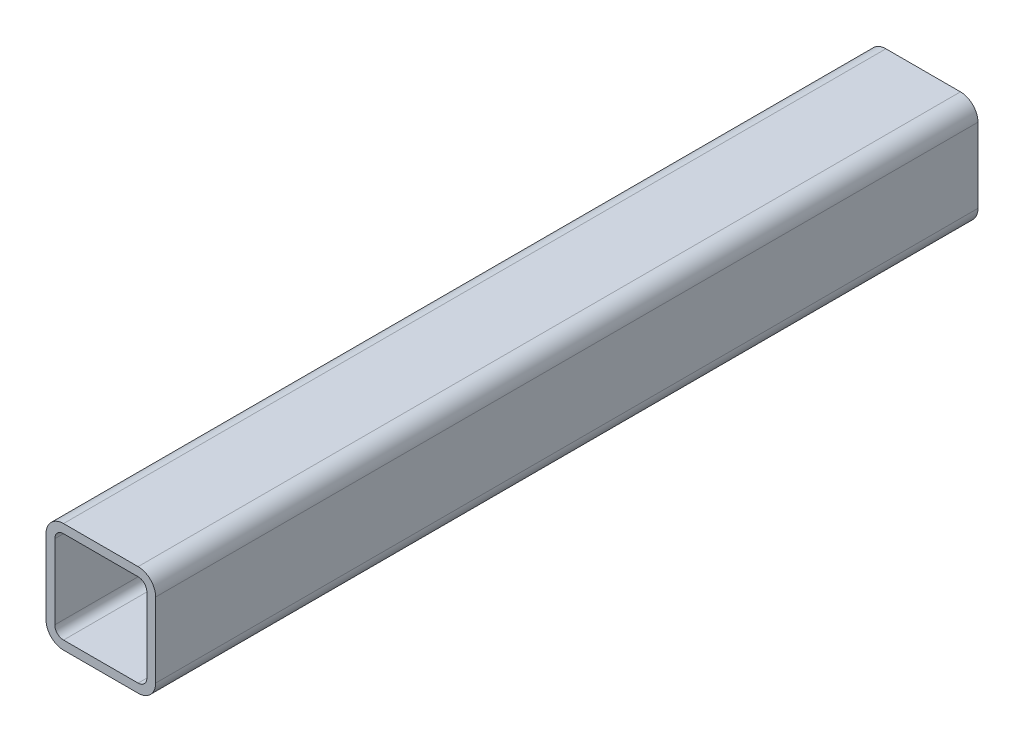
ISO-10303-21;
HEADER;
FILE_DESCRIPTION(('STEP AP214'),'2;1');
FILE_NAME('part.step','',(''),(''),'','','');
FILE_SCHEMA(('AUTOMOTIVE_DESIGN { 1 0 10303 214 1 1 1 1 }'));
ENDSEC;
DATA;
#1=APPLICATION_CONTEXT('core data for automotive mechanical design processes');
#2=APPLICATION_PROTOCOL_DEFINITION('international standard','automotive_design',2000,#1);
#3=PRODUCT_CONTEXT('',#1,'mechanical');
#4=PRODUCT('Part','Part','',(#3));
#5=PRODUCT_RELATED_PRODUCT_CATEGORY('part','',(#4));
#6=PRODUCT_DEFINITION_FORMATION('','',#4);
#7=PRODUCT_DEFINITION_CONTEXT('part definition',#1,'design');
#8=PRODUCT_DEFINITION('design','',#6,#7);
#9=PRODUCT_DEFINITION_SHAPE('','',#8);
#10=(LENGTH_UNIT() NAMED_UNIT(*) SI_UNIT(.MILLI.,.METRE.));
#11=(NAMED_UNIT(*) PLANE_ANGLE_UNIT() SI_UNIT($,.RADIAN.));
#12=(NAMED_UNIT(*) SI_UNIT($,.STERADIAN.) SOLID_ANGLE_UNIT());
#13=UNCERTAINTY_MEASURE_WITH_UNIT(LENGTH_MEASURE(1.E-05),#10,'distance_accuracy_value','');
#14=(GEOMETRIC_REPRESENTATION_CONTEXT(3) GLOBAL_UNCERTAINTY_ASSIGNED_CONTEXT((#13)) GLOBAL_UNIT_ASSIGNED_CONTEXT((#10,
#11,#12)) REPRESENTATION_CONTEXT('',''));
#15=CARTESIAN_POINT('',(0.,0.,0.));
#16=DIRECTION('',(0.,0.,1.));
#17=DIRECTION('',(1.,0.,0.));
#18=AXIS2_PLACEMENT_3D('',#15,#16,#17);
#19=CARTESIAN_POINT('',(-34.,34.,375.));
#20=DIRECTION('',(0.,0.,1.));
#21=DIRECTION('',(1.,0.,0.));
#22=AXIS2_PLACEMENT_3D('',#19,#20,#21);
#23=PLANE('',#22);
#24=CARTESIAN_POINT('',(-34.,34.,375.));
#25=DIRECTION('',(0.,0.,1.));
#26=DIRECTION('',(1.,0.,0.));
#27=AXIS2_PLACEMENT_3D('',#24,#25,#26);
#28=CIRCLE('',#27,16.);
#29=CARTESIAN_POINT('',(-34.,50.,375.));
#30=VERTEX_POINT('',#29);
#31=CARTESIAN_POINT('',(-50.,34.,375.));
#32=VERTEX_POINT('',#31);
#33=EDGE_CURVE('E258',#30,#32,#28,.T.);
#34=ORIENTED_EDGE('',*,*,#33,.T.);
#35=DIRECTION('',(0.,-1.,0.));
#36=VECTOR('',#35,1.);
#37=CARTESIAN_POINT('',(-50.,34.,375.));
#38=LINE('',#37,#36);
#39=CARTESIAN_POINT('',(-50.,-34.,375.));
#40=VERTEX_POINT('',#39);
#41=EDGE_CURVE('E261',#32,#40,#38,.T.);
#42=ORIENTED_EDGE('',*,*,#41,.T.);
#43=CARTESIAN_POINT('',(-34.,-34.,375.));
#44=DIRECTION('',(0.,0.,1.));
#45=DIRECTION('',(1.,0.,0.));
#46=AXIS2_PLACEMENT_3D('',#43,#44,#45);
#47=CIRCLE('',#46,16.);
#48=CARTESIAN_POINT('',(-34.,-50.,375.));
#49=VERTEX_POINT('',#48);
#50=EDGE_CURVE('E264',#40,#49,#47,.T.);
#51=ORIENTED_EDGE('',*,*,#50,.T.);
#52=DIRECTION('',(1.,0.,0.));
#53=VECTOR('',#52,1.);
#54=CARTESIAN_POINT('',(-34.,-50.,375.));
#55=LINE('',#54,#53);
#56=CARTESIAN_POINT('',(34.,-50.,375.));
#57=VERTEX_POINT('',#56);
#58=EDGE_CURVE('E266',#49,#57,#55,.T.);
#59=ORIENTED_EDGE('',*,*,#58,.T.);
#60=CARTESIAN_POINT('',(34.,-34.,375.));
#61=DIRECTION('',(0.,0.,1.));
#62=DIRECTION('',(1.,0.,0.));
#63=AXIS2_PLACEMENT_3D('',#60,#61,#62);
#64=CIRCLE('',#63,16.);
#65=CARTESIAN_POINT('',(50.,-34.,375.));
#66=VERTEX_POINT('',#65);
#67=EDGE_CURVE('E268',#57,#66,#64,.T.);
#68=ORIENTED_EDGE('',*,*,#67,.T.);
#69=DIRECTION('',(0.,1.,0.));
#70=VECTOR('',#69,1.);
#71=CARTESIAN_POINT('',(50.,34.,375.));
#72=LINE('',#71,#70);
#73=CARTESIAN_POINT('',(50.,34.,375.));
#74=VERTEX_POINT('',#73);
#75=EDGE_CURVE('E270',#66,#74,#72,.T.);
#76=ORIENTED_EDGE('',*,*,#75,.T.);
#77=CARTESIAN_POINT('',(34.,34.,375.));
#78=DIRECTION('',(0.,0.,1.));
#79=DIRECTION('',(-1.,0.,0.));
#80=AXIS2_PLACEMENT_3D('',#77,#78,#79);
#81=CIRCLE('',#80,16.);
#82=CARTESIAN_POINT('',(34.,50.,375.));
#83=VERTEX_POINT('',#82);
#84=EDGE_CURVE('E272',#74,#83,#81,.T.);
#85=ORIENTED_EDGE('',*,*,#84,.T.);
#86=DIRECTION('',(-1.,0.,0.));
#87=VECTOR('',#86,1.);
#88=CARTESIAN_POINT('',(-34.,50.,375.));
#89=LINE('',#88,#87);
#90=EDGE_CURVE('E274',#83,#30,#89,.T.);
#91=ORIENTED_EDGE('',*,*,#90,.T.);
#92=EDGE_LOOP('',(#34,#42,#51,#59,#68,#76,#85,#91));
#93=FACE_BOUND('',#92,.T.);
#94=DIRECTION('',(0.,-1.,0.));
#95=VECTOR('',#94,1.);
#96=CARTESIAN_POINT('',(-42.,34.,375.));
#97=LINE('',#96,#95);
#98=CARTESIAN_POINT('',(-42.,34.,375.));
#99=VERTEX_POINT('',#98);
#100=CARTESIAN_POINT('',(-42.,-34.,375.));
#101=VERTEX_POINT('',#100);
#102=EDGE_CURVE('E201',#99,#101,#97,.T.);
#103=ORIENTED_EDGE('',*,*,#102,.F.);
#104=CARTESIAN_POINT('',(-34.,34.,375.));
#105=DIRECTION('',(0.,0.,1.));
#106=DIRECTION('',(1.,0.,0.));
#107=AXIS2_PLACEMENT_3D('',#104,#105,#106);
#108=CIRCLE('',#107,8.);
#109=CARTESIAN_POINT('',(-34.,42.,375.));
#110=VERTEX_POINT('',#109);
#111=EDGE_CURVE('E193',#110,#99,#108,.T.);
#112=ORIENTED_EDGE('',*,*,#111,.F.);
#113=DIRECTION('',(-1.,0.,0.));
#114=VECTOR('',#113,1.);
#115=CARTESIAN_POINT('',(-34.,42.,375.));
#116=LINE('',#115,#114);
#117=CARTESIAN_POINT('',(34.,42.,375.));
#118=VERTEX_POINT('',#117);
#119=EDGE_CURVE('E226',#118,#110,#116,.T.);
#120=ORIENTED_EDGE('',*,*,#119,.F.);
#121=CARTESIAN_POINT('',(34.,34.,375.));
#122=DIRECTION('',(0.,0.,1.));
#123=DIRECTION('',(1.,0.,0.));
#124=AXIS2_PLACEMENT_3D('',#121,#122,#123);
#125=CIRCLE('',#124,8.);
#126=CARTESIAN_POINT('',(42.,34.,375.));
#127=VERTEX_POINT('',#126);
#128=EDGE_CURVE('E224',#127,#118,#125,.T.);
#129=ORIENTED_EDGE('',*,*,#128,.F.);
#130=DIRECTION('',(0.,1.,0.));
#131=VECTOR('',#130,1.);
#132=CARTESIAN_POINT('',(42.,34.,375.));
#133=LINE('',#132,#131);
#134=CARTESIAN_POINT('',(42.,-34.,375.));
#135=VERTEX_POINT('',#134);
#136=EDGE_CURVE('E222',#135,#127,#133,.T.);
#137=ORIENTED_EDGE('',*,*,#136,.F.);
#138=CARTESIAN_POINT('',(34.,-34.,375.));
#139=DIRECTION('',(0.,0.,1.));
#140=DIRECTION('',(1.,0.,0.));
#141=AXIS2_PLACEMENT_3D('',#138,#139,#140);
#142=CIRCLE('',#141,8.);
#143=CARTESIAN_POINT('',(34.,-42.,375.));
#144=VERTEX_POINT('',#143);
#145=EDGE_CURVE('E220',#144,#135,#142,.T.);
#146=ORIENTED_EDGE('',*,*,#145,.F.);
#147=DIRECTION('',(1.,0.,0.));
#148=VECTOR('',#147,1.);
#149=CARTESIAN_POINT('',(-34.,-42.,375.));
#150=LINE('',#149,#148);
#151=CARTESIAN_POINT('',(-34.,-42.,375.));
#152=VERTEX_POINT('',#151);
#153=EDGE_CURVE('E216',#152,#144,#150,.T.);
#154=ORIENTED_EDGE('',*,*,#153,.F.);
#155=CARTESIAN_POINT('',(-34.,-34.,375.));
#156=DIRECTION('',(0.,0.,1.));
#157=DIRECTION('',(1.,0.,0.));
#158=AXIS2_PLACEMENT_3D('',#155,#156,#157);
#159=CIRCLE('',#158,8.);
#160=EDGE_CURVE('E214',#101,#152,#159,.T.);
#161=ORIENTED_EDGE('',*,*,#160,.F.);
#162=EDGE_LOOP('',(#103,#112,#120,#129,#137,#146,#154,#161));
#163=FACE_BOUND('',#162,.T.);
#164=ADVANCED_FACE('F80',(#93,#163),#23,.T.);
#165=CARTESIAN_POINT('',(-34.,34.,-375.));
#166=DIRECTION('',(0.,0.,1.));
#167=DIRECTION('',(1.,0.,0.));
#168=AXIS2_PLACEMENT_3D('',#165,#166,#167);
#169=PLANE('',#168);
#170=CARTESIAN_POINT('',(-34.,34.,-375.));
#171=DIRECTION('',(0.,0.,1.));
#172=DIRECTION('',(1.,0.,0.));
#173=AXIS2_PLACEMENT_3D('',#170,#171,#172);
#174=CIRCLE('',#173,16.);
#175=CARTESIAN_POINT('',(-34.,50.,-375.));
#176=VERTEX_POINT('',#175);
#177=CARTESIAN_POINT('',(-50.,34.,-375.));
#178=VERTEX_POINT('',#177);
#179=EDGE_CURVE('E209',#176,#178,#174,.T.);
#180=ORIENTED_EDGE('',*,*,#179,.F.);
#181=DIRECTION('',(-1.,0.,0.));
#182=VECTOR('',#181,1.);
#183=CARTESIAN_POINT('',(-34.,50.,-375.));
#184=LINE('',#183,#182);
#185=CARTESIAN_POINT('',(34.,50.,-375.));
#186=VERTEX_POINT('',#185);
#187=EDGE_CURVE('E262',#186,#176,#184,.T.);
#188=ORIENTED_EDGE('',*,*,#187,.F.);
#189=CARTESIAN_POINT('',(34.,34.,-375.));
#190=DIRECTION('',(0.,0.,1.));
#191=DIRECTION('',(-1.,0.,0.));
#192=AXIS2_PLACEMENT_3D('',#189,#190,#191);
#193=CIRCLE('',#192,16.);
#194=CARTESIAN_POINT('',(50.,34.,-375.));
#195=VERTEX_POINT('',#194);
#196=EDGE_CURVE('E289',#195,#186,#193,.T.);
#197=ORIENTED_EDGE('',*,*,#196,.F.);
#198=DIRECTION('',(0.,1.,0.));
#199=VECTOR('',#198,1.);
#200=CARTESIAN_POINT('',(50.,34.,-375.));
#201=LINE('',#200,#199);
#202=CARTESIAN_POINT('',(50.,-34.,-375.));
#203=VERTEX_POINT('',#202);
#204=EDGE_CURVE('E287',#203,#195,#201,.T.);
#205=ORIENTED_EDGE('',*,*,#204,.F.);
#206=CARTESIAN_POINT('',(34.,-34.,-375.));
#207=DIRECTION('',(0.,0.,1.));
#208=DIRECTION('',(1.,0.,0.));
#209=AXIS2_PLACEMENT_3D('',#206,#207,#208);
#210=CIRCLE('',#209,16.);
#211=CARTESIAN_POINT('',(34.,-50.,-375.));
#212=VERTEX_POINT('',#211);
#213=EDGE_CURVE('E285',#212,#203,#210,.T.);
#214=ORIENTED_EDGE('',*,*,#213,.F.);
#215=DIRECTION('',(1.,0.,0.));
#216=VECTOR('',#215,1.);
#217=CARTESIAN_POINT('',(-34.,-50.,-375.));
#218=LINE('',#217,#216);
#219=CARTESIAN_POINT('',(-34.,-50.,-375.));
#220=VERTEX_POINT('',#219);
#221=EDGE_CURVE('E283',#220,#212,#218,.T.);
#222=ORIENTED_EDGE('',*,*,#221,.F.);
#223=CARTESIAN_POINT('',(-34.,-34.,-375.));
#224=DIRECTION('',(0.,0.,1.));
#225=DIRECTION('',(1.,0.,0.));
#226=AXIS2_PLACEMENT_3D('',#223,#224,#225);
#227=CIRCLE('',#226,16.);
#228=CARTESIAN_POINT('',(-50.,-34.,-375.));
#229=VERTEX_POINT('',#228);
#230=EDGE_CURVE('E281',#229,#220,#227,.T.);
#231=ORIENTED_EDGE('',*,*,#230,.F.);
#232=DIRECTION('',(0.,-1.,0.));
#233=VECTOR('',#232,1.);
#234=CARTESIAN_POINT('',(-50.,34.,-375.));
#235=LINE('',#234,#233);
#236=EDGE_CURVE('E279',#178,#229,#235,.T.);
#237=ORIENTED_EDGE('',*,*,#236,.F.);
#238=EDGE_LOOP('',(#180,#188,#197,#205,#214,#222,#231,#237));
#239=FACE_BOUND('',#238,.T.);
#240=CARTESIAN_POINT('',(-34.,34.,-375.));
#241=DIRECTION('',(0.,0.,1.));
#242=DIRECTION('',(1.,0.,0.));
#243=AXIS2_PLACEMENT_3D('',#240,#241,#242);
#244=CIRCLE('',#243,8.);
#245=CARTESIAN_POINT('',(-34.,42.,-375.));
#246=VERTEX_POINT('',#245);
#247=CARTESIAN_POINT('',(-42.,34.,-375.));
#248=VERTEX_POINT('',#247);
#249=EDGE_CURVE('E103',#246,#248,#244,.T.);
#250=ORIENTED_EDGE('',*,*,#249,.T.);
#251=DIRECTION('',(0.,-1.,0.));
#252=VECTOR('',#251,1.);
#253=CARTESIAN_POINT('',(-42.,34.,-375.));
#254=LINE('',#253,#252);
#255=CARTESIAN_POINT('',(-42.,-34.,-375.));
#256=VERTEX_POINT('',#255);
#257=EDGE_CURVE('E208',#248,#256,#254,.T.);
#258=ORIENTED_EDGE('',*,*,#257,.T.);
#259=CARTESIAN_POINT('',(-34.,-34.,-375.));
#260=DIRECTION('',(0.,0.,1.));
#261=DIRECTION('',(1.,0.,0.));
#262=AXIS2_PLACEMENT_3D('',#259,#260,#261);
#263=CIRCLE('',#262,8.);
#264=CARTESIAN_POINT('',(-34.,-42.,-375.));
#265=VERTEX_POINT('',#264);
#266=EDGE_CURVE('E230',#256,#265,#263,.T.);
#267=ORIENTED_EDGE('',*,*,#266,.T.);
#268=DIRECTION('',(1.,0.,0.));
#269=VECTOR('',#268,1.);
#270=CARTESIAN_POINT('',(-34.,-42.,-375.));
#271=LINE('',#270,#269);
#272=CARTESIAN_POINT('',(34.,-42.,-375.));
#273=VERTEX_POINT('',#272);
#274=EDGE_CURVE('E233',#265,#273,#271,.T.);
#275=ORIENTED_EDGE('',*,*,#274,.T.);
#276=CARTESIAN_POINT('',(34.,-34.,-375.));
#277=DIRECTION('',(0.,0.,1.));
#278=DIRECTION('',(1.,0.,0.));
#279=AXIS2_PLACEMENT_3D('',#276,#277,#278);
#280=CIRCLE('',#279,8.);
#281=CARTESIAN_POINT('',(42.,-34.,-375.));
#282=VERTEX_POINT('',#281);
#283=EDGE_CURVE('E236',#273,#282,#280,.T.);
#284=ORIENTED_EDGE('',*,*,#283,.T.);
#285=DIRECTION('',(0.,1.,0.));
#286=VECTOR('',#285,1.);
#287=CARTESIAN_POINT('',(42.,34.,-375.));
#288=LINE('',#287,#286);
#289=CARTESIAN_POINT('',(42.,34.,-375.));
#290=VERTEX_POINT('',#289);
#291=EDGE_CURVE('E239',#282,#290,#288,.T.);
#292=ORIENTED_EDGE('',*,*,#291,.T.);
#293=CARTESIAN_POINT('',(34.,34.,-375.));
#294=DIRECTION('',(0.,0.,1.));
#295=DIRECTION('',(1.,0.,0.));
#296=AXIS2_PLACEMENT_3D('',#293,#294,#295);
#297=CIRCLE('',#296,8.);
#298=CARTESIAN_POINT('',(34.,42.,-375.));
#299=VERTEX_POINT('',#298);
#300=EDGE_CURVE('E242',#290,#299,#297,.T.);
#301=ORIENTED_EDGE('',*,*,#300,.T.);
#302=DIRECTION('',(-1.,0.,0.));
#303=VECTOR('',#302,1.);
#304=CARTESIAN_POINT('',(-34.,42.,-375.));
#305=LINE('',#304,#303);
#306=EDGE_CURVE('E202',#299,#246,#305,.T.);
#307=ORIENTED_EDGE('',*,*,#306,.T.);
#308=EDGE_LOOP('',(#250,#258,#267,#275,#284,#292,#301,#307));
#309=FACE_BOUND('',#308,.T.);
#310=ADVANCED_FACE('F319',(#239,#309),#169,.F.);
#311=CARTESIAN_POINT('',(-34.,34.,375.));
#312=DIRECTION('',(0.,0.,-1.));
#313=DIRECTION('',(-1.,0.,0.));
#314=AXIS2_PLACEMENT_3D('',#311,#312,#313);
#315=CYLINDRICAL_SURFACE('',#314,16.);
#316=ORIENTED_EDGE('',*,*,#179,.T.);
#317=DIRECTION('',(0.,0.,-1.));
#318=VECTOR('',#317,1.);
#319=CARTESIAN_POINT('',(-50.,34.,375.));
#320=LINE('',#319,#318);
#321=EDGE_CURVE('E12',#32,#178,#320,.T.);
#322=ORIENTED_EDGE('',*,*,#321,.F.);
#323=ORIENTED_EDGE('',*,*,#33,.F.);
#324=DIRECTION('',(0.,0.,-1.));
#325=VECTOR('',#324,1.);
#326=CARTESIAN_POINT('',(-34.,50.,375.));
#327=LINE('',#326,#325);
#328=EDGE_CURVE('E276',#30,#176,#327,.T.);
#329=ORIENTED_EDGE('',*,*,#328,.T.);
#330=EDGE_LOOP('',(#316,#322,#323,#329));
#331=FACE_BOUND('',#330,.T.);
#332=ADVANCED_FACE('F82',(#331),#315,.T.);
#333=CARTESIAN_POINT('',(-50.,34.,375.));
#334=DIRECTION('',(1.,0.,0.));
#335=DIRECTION('',(0.,1.,0.));
#336=AXIS2_PLACEMENT_3D('',#333,#334,#335);
#337=PLANE('',#336);
#338=ORIENTED_EDGE('',*,*,#236,.T.);
#339=DIRECTION('',(0.,0.,-1.));
#340=VECTOR('',#339,1.);
#341=CARTESIAN_POINT('',(-50.,-34.,375.));
#342=LINE('',#341,#340);
#343=EDGE_CURVE('E88',#40,#229,#342,.T.);
#344=ORIENTED_EDGE('',*,*,#343,.F.);
#345=ORIENTED_EDGE('',*,*,#41,.F.);
#346=ORIENTED_EDGE('',*,*,#321,.T.);
#347=EDGE_LOOP('',(#338,#344,#345,#346));
#348=FACE_BOUND('',#347,.T.);
#349=ADVANCED_FACE('F336',(#348),#337,.F.);
#350=CARTESIAN_POINT('',(-34.,-34.,375.));
#351=DIRECTION('',(0.,0.,-1.));
#352=DIRECTION('',(-1.,0.,0.));
#353=AXIS2_PLACEMENT_3D('',#350,#351,#352);
#354=CYLINDRICAL_SURFACE('',#353,16.);
#355=ORIENTED_EDGE('',*,*,#230,.T.);
#356=DIRECTION('',(0.,0.,-1.));
#357=VECTOR('',#356,1.);
#358=CARTESIAN_POINT('',(-34.,-50.,375.));
#359=LINE('',#358,#357);
#360=EDGE_CURVE('E306',#49,#220,#359,.T.);
#361=ORIENTED_EDGE('',*,*,#360,.F.);
#362=ORIENTED_EDGE('',*,*,#50,.F.);
#363=ORIENTED_EDGE('',*,*,#343,.T.);
#364=EDGE_LOOP('',(#355,#361,#362,#363));
#365=FACE_BOUND('',#364,.T.);
#366=ADVANCED_FACE('F313',(#365),#354,.T.);
#367=CARTESIAN_POINT('',(-34.,-50.,375.));
#368=DIRECTION('',(0.,1.,0.));
#369=DIRECTION('',(0.,0.,1.));
#370=AXIS2_PLACEMENT_3D('',#367,#368,#369);
#371=PLANE('',#370);
#372=ORIENTED_EDGE('',*,*,#221,.T.);
#373=DIRECTION('',(0.,0.,-1.));
#374=VECTOR('',#373,1.);
#375=CARTESIAN_POINT('',(34.,-50.,375.));
#376=LINE('',#375,#374);
#377=EDGE_CURVE('E303',#57,#212,#376,.T.);
#378=ORIENTED_EDGE('',*,*,#377,.F.);
#379=ORIENTED_EDGE('',*,*,#58,.F.);
#380=ORIENTED_EDGE('',*,*,#360,.T.);
#381=EDGE_LOOP('',(#372,#378,#379,#380));
#382=FACE_BOUND('',#381,.T.);
#383=ADVANCED_FACE('F325',(#382),#371,.F.);
#384=CARTESIAN_POINT('',(34.,-34.,375.));
#385=DIRECTION('',(0.,0.,-1.));
#386=DIRECTION('',(-1.,0.,0.));
#387=AXIS2_PLACEMENT_3D('',#384,#385,#386);
#388=CYLINDRICAL_SURFACE('',#387,16.);
#389=ORIENTED_EDGE('',*,*,#213,.T.);
#390=DIRECTION('',(0.,0.,-1.));
#391=VECTOR('',#390,1.);
#392=CARTESIAN_POINT('',(50.,-34.,375.));
#393=LINE('',#392,#391);
#394=EDGE_CURVE('E300',#66,#203,#393,.T.);
#395=ORIENTED_EDGE('',*,*,#394,.F.);
#396=ORIENTED_EDGE('',*,*,#67,.F.);
#397=ORIENTED_EDGE('',*,*,#377,.T.);
#398=EDGE_LOOP('',(#389,#395,#396,#397));
#399=FACE_BOUND('',#398,.T.);
#400=ADVANCED_FACE('F329',(#399),#388,.T.);
#401=CARTESIAN_POINT('',(50.,34.,375.));
#402=DIRECTION('',(-1.,0.,0.));
#403=DIRECTION('',(0.,-1.,0.));
#404=AXIS2_PLACEMENT_3D('',#401,#402,#403);
#405=PLANE('',#404);
#406=ORIENTED_EDGE('',*,*,#204,.T.);
#407=DIRECTION('',(0.,0.,-1.));
#408=VECTOR('',#407,1.);
#409=CARTESIAN_POINT('',(50.,34.,375.));
#410=LINE('',#409,#408);
#411=EDGE_CURVE('E297',#74,#195,#410,.T.);
#412=ORIENTED_EDGE('',*,*,#411,.F.);
#413=ORIENTED_EDGE('',*,*,#75,.F.);
#414=ORIENTED_EDGE('',*,*,#394,.T.);
#415=EDGE_LOOP('',(#406,#412,#413,#414));
#416=FACE_BOUND('',#415,.T.);
#417=ADVANCED_FACE('F349',(#416),#405,.F.);
#418=CARTESIAN_POINT('',(34.,34.,375.));
#419=DIRECTION('',(0.,0.,-1.));
#420=DIRECTION('',(-1.,0.,0.));
#421=AXIS2_PLACEMENT_3D('',#418,#419,#420);
#422=CYLINDRICAL_SURFACE('',#421,16.);
#423=ORIENTED_EDGE('',*,*,#196,.T.);
#424=DIRECTION('',(0.,0.,-1.));
#425=VECTOR('',#424,1.);
#426=CARTESIAN_POINT('',(34.,50.,375.));
#427=LINE('',#426,#425);
#428=EDGE_CURVE('E294',#83,#186,#427,.T.);
#429=ORIENTED_EDGE('',*,*,#428,.F.);
#430=ORIENTED_EDGE('',*,*,#84,.F.);
#431=ORIENTED_EDGE('',*,*,#411,.T.);
#432=EDGE_LOOP('',(#423,#429,#430,#431));
#433=FACE_BOUND('',#432,.T.);
#434=ADVANCED_FACE('F347',(#433),#422,.T.);
#435=CARTESIAN_POINT('',(-34.,50.,375.));
#436=DIRECTION('',(0.,-1.,0.));
#437=DIRECTION('',(1.,0.,0.));
#438=AXIS2_PLACEMENT_3D('',#435,#436,#437);
#439=PLANE('',#438);
#440=ORIENTED_EDGE('',*,*,#187,.T.);
#441=ORIENTED_EDGE('',*,*,#328,.F.);
#442=ORIENTED_EDGE('',*,*,#90,.F.);
#443=ORIENTED_EDGE('',*,*,#428,.T.);
#444=EDGE_LOOP('',(#440,#441,#442,#443));
#445=FACE_BOUND('',#444,.T.);
#446=ADVANCED_FACE('F342',(#445),#439,.F.);
#447=CARTESIAN_POINT('',(-34.,34.,375.));
#448=DIRECTION('',(0.,0.,-1.));
#449=DIRECTION('',(-1.,0.,0.));
#450=AXIS2_PLACEMENT_3D('',#447,#448,#449);
#451=CYLINDRICAL_SURFACE('',#450,8.);
#452=ORIENTED_EDGE('',*,*,#249,.F.);
#453=DIRECTION('',(0.,0.,-1.));
#454=VECTOR('',#453,1.);
#455=CARTESIAN_POINT('',(-34.,42.,375.));
#456=LINE('',#455,#454);
#457=EDGE_CURVE('E197',#110,#246,#456,.T.);
#458=ORIENTED_EDGE('',*,*,#457,.F.);
#459=ORIENTED_EDGE('',*,*,#111,.T.);
#460=DIRECTION('',(0.,0.,-1.));
#461=VECTOR('',#460,1.);
#462=CARTESIAN_POINT('',(-42.,34.,375.));
#463=LINE('',#462,#461);
#464=EDGE_CURVE('E196',#99,#248,#463,.T.);
#465=ORIENTED_EDGE('',*,*,#464,.T.);
#466=EDGE_LOOP('',(#452,#458,#459,#465));
#467=FACE_BOUND('',#466,.T.);
#468=ADVANCED_FACE('F195',(#467),#451,.F.);
#469=CARTESIAN_POINT('',(-42.,34.,375.));
#470=DIRECTION('',(1.,0.,0.));
#471=DIRECTION('',(0.,1.,0.));
#472=AXIS2_PLACEMENT_3D('',#469,#470,#471);
#473=PLANE('',#472);
#474=ORIENTED_EDGE('',*,*,#257,.F.);
#475=ORIENTED_EDGE('',*,*,#464,.F.);
#476=ORIENTED_EDGE('',*,*,#102,.T.);
#477=DIRECTION('',(0.,0.,-1.));
#478=VECTOR('',#477,1.);
#479=CARTESIAN_POINT('',(-42.,-34.,375.));
#480=LINE('',#479,#478);
#481=EDGE_CURVE('E210',#101,#256,#480,.T.);
#482=ORIENTED_EDGE('',*,*,#481,.T.);
#483=EDGE_LOOP('',(#474,#475,#476,#482));
#484=FACE_BOUND('',#483,.T.);
#485=ADVANCED_FACE('F205',(#484),#473,.T.);
#486=CARTESIAN_POINT('',(-34.,-34.,375.));
#487=DIRECTION('',(0.,0.,-1.));
#488=DIRECTION('',(-1.,0.,0.));
#489=AXIS2_PLACEMENT_3D('',#486,#487,#488);
#490=CYLINDRICAL_SURFACE('',#489,8.);
#491=ORIENTED_EDGE('',*,*,#266,.F.);
#492=ORIENTED_EDGE('',*,*,#481,.F.);
#493=ORIENTED_EDGE('',*,*,#160,.T.);
#494=DIRECTION('',(0.,0.,-1.));
#495=VECTOR('',#494,1.);
#496=CARTESIAN_POINT('',(-34.,-42.,375.));
#497=LINE('',#496,#495);
#498=EDGE_CURVE('E255',#152,#265,#497,.T.);
#499=ORIENTED_EDGE('',*,*,#498,.T.);
#500=EDGE_LOOP('',(#491,#492,#493,#499));
#501=FACE_BOUND('',#500,.T.);
#502=ADVANCED_FACE('F374',(#501),#490,.F.);
#503=CARTESIAN_POINT('',(-34.,-42.,375.));
#504=DIRECTION('',(0.,1.,0.));
#505=DIRECTION('',(0.,0.,1.));
#506=AXIS2_PLACEMENT_3D('',#503,#504,#505);
#507=PLANE('',#506);
#508=ORIENTED_EDGE('',*,*,#274,.F.);
#509=ORIENTED_EDGE('',*,*,#498,.F.);
#510=ORIENTED_EDGE('',*,*,#153,.T.);
#511=DIRECTION('',(0.,0.,-1.));
#512=VECTOR('',#511,1.);
#513=CARTESIAN_POINT('',(34.,-42.,375.));
#514=LINE('',#513,#512);
#515=EDGE_CURVE('E253',#144,#273,#514,.T.);
#516=ORIENTED_EDGE('',*,*,#515,.T.);
#517=EDGE_LOOP('',(#508,#509,#510,#516));
#518=FACE_BOUND('',#517,.T.);
#519=ADVANCED_FACE('F378',(#518),#507,.T.);
#520=CARTESIAN_POINT('',(34.,-34.,375.));
#521=DIRECTION('',(0.,0.,-1.));
#522=DIRECTION('',(-1.,0.,0.));
#523=AXIS2_PLACEMENT_3D('',#520,#521,#522);
#524=CYLINDRICAL_SURFACE('',#523,8.);
#525=ORIENTED_EDGE('',*,*,#283,.F.);
#526=ORIENTED_EDGE('',*,*,#515,.F.);
#527=ORIENTED_EDGE('',*,*,#145,.T.);
#528=DIRECTION('',(0.,0.,-1.));
#529=VECTOR('',#528,1.);
#530=CARTESIAN_POINT('',(42.,-34.,375.));
#531=LINE('',#530,#529);
#532=EDGE_CURVE('E251',#135,#282,#531,.T.);
#533=ORIENTED_EDGE('',*,*,#532,.T.);
#534=EDGE_LOOP('',(#525,#526,#527,#533));
#535=FACE_BOUND('',#534,.T.);
#536=ADVANCED_FACE('F384',(#535),#524,.F.);
#537=CARTESIAN_POINT('',(42.,34.,375.));
#538=DIRECTION('',(-1.,0.,0.));
#539=DIRECTION('',(0.,-1.,0.));
#540=AXIS2_PLACEMENT_3D('',#537,#538,#539);
#541=PLANE('',#540);
#542=ORIENTED_EDGE('',*,*,#291,.F.);
#543=ORIENTED_EDGE('',*,*,#532,.F.);
#544=ORIENTED_EDGE('',*,*,#136,.T.);
#545=DIRECTION('',(0.,0.,-1.));
#546=VECTOR('',#545,1.);
#547=CARTESIAN_POINT('',(42.,34.,375.));
#548=LINE('',#547,#546);
#549=EDGE_CURVE('E249',#127,#290,#548,.T.);
#550=ORIENTED_EDGE('',*,*,#549,.T.);
#551=EDGE_LOOP('',(#542,#543,#544,#550));
#552=FACE_BOUND('',#551,.T.);
#553=ADVANCED_FACE('F388',(#552),#541,.T.);
#554=CARTESIAN_POINT('',(34.,34.,375.));
#555=DIRECTION('',(0.,0.,-1.));
#556=DIRECTION('',(-1.,0.,0.));
#557=AXIS2_PLACEMENT_3D('',#554,#555,#556);
#558=CYLINDRICAL_SURFACE('',#557,8.);
#559=ORIENTED_EDGE('',*,*,#300,.F.);
#560=ORIENTED_EDGE('',*,*,#549,.F.);
#561=ORIENTED_EDGE('',*,*,#128,.T.);
#562=DIRECTION('',(0.,0.,-1.));
#563=VECTOR('',#562,1.);
#564=CARTESIAN_POINT('',(34.,42.,375.));
#565=LINE('',#564,#563);
#566=EDGE_CURVE('E95',#118,#299,#565,.T.);
#567=ORIENTED_EDGE('',*,*,#566,.T.);
#568=EDGE_LOOP('',(#559,#560,#561,#567));
#569=FACE_BOUND('',#568,.T.);
#570=ADVANCED_FACE('F392',(#569),#558,.F.);
#571=CARTESIAN_POINT('',(-34.,42.,375.));
#572=DIRECTION('',(0.,-1.,0.));
#573=DIRECTION('',(1.,0.,0.));
#574=AXIS2_PLACEMENT_3D('',#571,#572,#573);
#575=PLANE('',#574);
#576=ORIENTED_EDGE('',*,*,#306,.F.);
#577=ORIENTED_EDGE('',*,*,#566,.F.);
#578=ORIENTED_EDGE('',*,*,#119,.T.);
#579=ORIENTED_EDGE('',*,*,#457,.T.);
#580=EDGE_LOOP('',(#576,#577,#578,#579));
#581=FACE_BOUND('',#580,.T.);
#582=ADVANCED_FACE('F396',(#581),#575,.T.);
#583=CLOSED_SHELL('',(#164,#310,#332,#349,#366,#383,#400,#417,#434,#446,#468,#485,#502,#519,
#536,#553,#570,#582));
#584=MANIFOLD_SOLID_BREP('B2',#583);
#585=ADVANCED_BREP_SHAPE_REPRESENTATION('',(#18,#584),#14);
#586=SHAPE_DEFINITION_REPRESENTATION(#9,#585);
ENDSEC;
END-ISO-10303-21;
